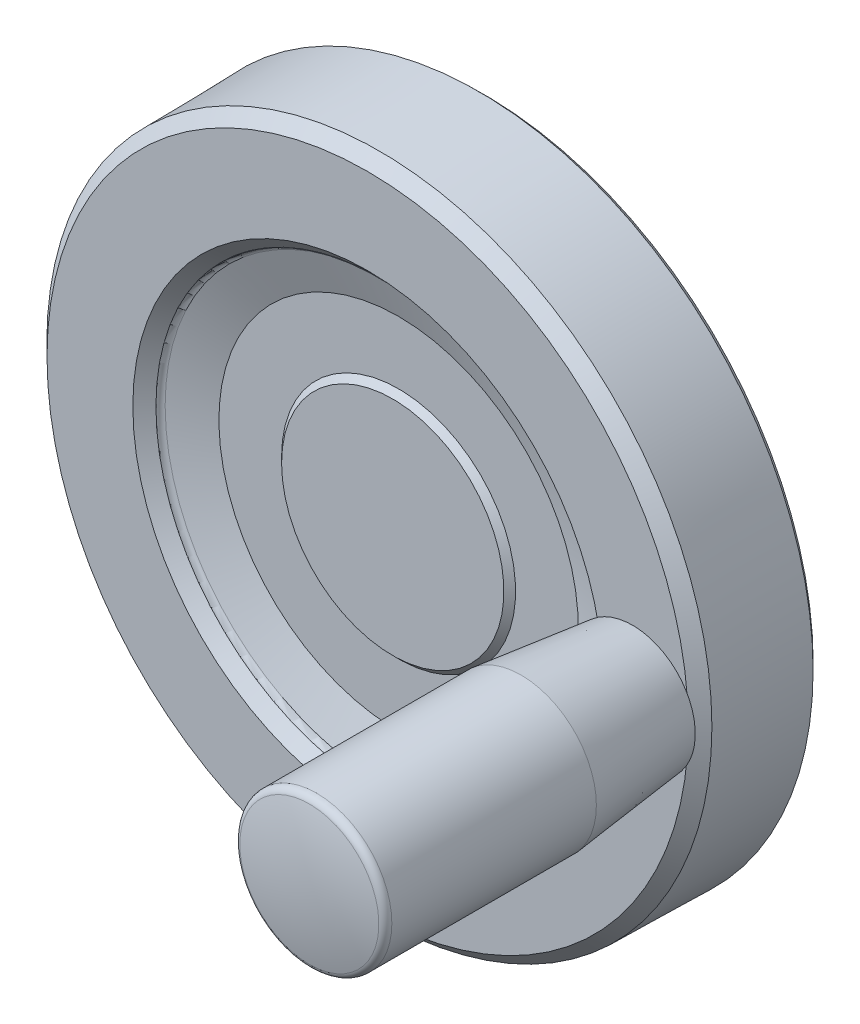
ISO-10303-21;
HEADER;
FILE_DESCRIPTION(('STEP AP214'),'2;1');
FILE_NAME('part.step','',(''),(''),'','','');
FILE_SCHEMA(('AUTOMOTIVE_DESIGN { 1 0 10303 214 1 1 1 1 }'));
ENDSEC;
DATA;
#1=APPLICATION_CONTEXT('core data for automotive mechanical design processes');
#2=APPLICATION_PROTOCOL_DEFINITION('international standard','automotive_design',2000,#1);
#3=PRODUCT_CONTEXT('',#1,'mechanical');
#4=PRODUCT('Part','Part','',(#3));
#5=PRODUCT_RELATED_PRODUCT_CATEGORY('part','',(#4));
#6=PRODUCT_DEFINITION_FORMATION('','',#4);
#7=PRODUCT_DEFINITION_CONTEXT('part definition',#1,'design');
#8=PRODUCT_DEFINITION('design','',#6,#7);
#9=PRODUCT_DEFINITION_SHAPE('','',#8);
#10=(LENGTH_UNIT() NAMED_UNIT(*) SI_UNIT(.MILLI.,.METRE.));
#11=(NAMED_UNIT(*) PLANE_ANGLE_UNIT() SI_UNIT($,.RADIAN.));
#12=(NAMED_UNIT(*) SI_UNIT($,.STERADIAN.) SOLID_ANGLE_UNIT());
#13=UNCERTAINTY_MEASURE_WITH_UNIT(LENGTH_MEASURE(1.E-05),#10,'distance_accuracy_value','');
#14=(GEOMETRIC_REPRESENTATION_CONTEXT(3) GLOBAL_UNCERTAINTY_ASSIGNED_CONTEXT((#13)) GLOBAL_UNIT_ASSIGNED_CONTEXT((#10,
#11,#12)) REPRESENTATION_CONTEXT('',''));
#15=CARTESIAN_POINT('',(0.,0.,0.));
#16=DIRECTION('',(0.,0.,1.));
#17=DIRECTION('',(1.,0.,0.));
#18=AXIS2_PLACEMENT_3D('',#15,#16,#17);
#19=CARTESIAN_POINT('',(32.,0.,18.613499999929));
#20=DIRECTION('',(0.,0.,1.));
#21=DIRECTION('',(-1.,0.,0.));
#22=AXIS2_PLACEMENT_3D('',#19,#20,#21);
#23=CONICAL_SURFACE('',#22,2.99999999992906,0.785398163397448);
#24=CARTESIAN_POINT('',(32.,0.,18.));
#25=DIRECTION('',(0.,0.,1.));
#26=DIRECTION('',(-1.,0.,0.));
#27=AXIS2_PLACEMENT_3D('',#24,#25,#26);
#28=CIRCLE('',#27,2.38650000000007);
#29=CARTESIAN_POINT('',(29.6134999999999,0.,18.));
#30=VERTEX_POINT('',#29);
#31=EDGE_CURVE('E168',#30,#30,#28,.T.);
#32=ORIENTED_EDGE('',*,*,#31,.T.);
#33=EDGE_LOOP('',(#32));
#34=FACE_BOUND('',#33,.T.);
#35=CARTESIAN_POINT('',(32.,0.,18.072));
#36=DIRECTION('',(0.,0.,1.));
#37=DIRECTION('',(0.,1.,0.));
#38=AXIS2_PLACEMENT_3D('',#35,#36,#37);
#39=CIRCLE('',#38,2.4585);
#40=CARTESIAN_POINT('',(32.,2.4585,18.072));
#41=VERTEX_POINT('',#40);
#42=EDGE_CURVE('E9',#41,#41,#39,.T.);
#43=ORIENTED_EDGE('',*,*,#42,.F.);
#44=EDGE_LOOP('',(#43));
#45=FACE_BOUND('',#44,.T.);
#46=ADVANCED_FACE('F15',(#34,#45),#23,.T.);
#47=CARTESIAN_POINT('',(32.,0.,18.));
#48=DIRECTION('',(0.,0.,1.));
#49=DIRECTION('',(-1.,0.,0.));
#50=AXIS2_PLACEMENT_3D('',#47,#48,#49);
#51=PLANE('',#50);
#52=DIRECTION('',(0.866025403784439,-0.5,0.));
#53=VECTOR('',#52,1.);
#54=CARTESIAN_POINT('',(33.5,0.866025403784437,18.));
#55=LINE('',#54,#53);
#56=CARTESIAN_POINT('',(32.,1.73205080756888,18.));
#57=VERTEX_POINT('',#56);
#58=CARTESIAN_POINT('',(33.5,0.866025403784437,18.));
#59=VERTEX_POINT('',#58);
#60=EDGE_CURVE('E35',#57,#59,#55,.T.);
#61=ORIENTED_EDGE('',*,*,#60,.F.);
#62=DIRECTION('',(0.866025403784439,0.5,0.));
#63=VECTOR('',#62,1.);
#64=CARTESIAN_POINT('',(32.,1.73205080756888,18.));
#65=LINE('',#64,#63);
#66=CARTESIAN_POINT('',(30.5,0.866025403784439,18.));
#67=VERTEX_POINT('',#66);
#68=EDGE_CURVE('E108',#67,#57,#65,.T.);
#69=ORIENTED_EDGE('',*,*,#68,.F.);
#70=DIRECTION('',(0.,-1.,0.));
#71=VECTOR('',#70,1.);
#72=CARTESIAN_POINT('',(30.5,0.866025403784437,18.));
#73=LINE('',#72,#71);
#74=CARTESIAN_POINT('',(30.5,-0.86602540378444,18.));
#75=VERTEX_POINT('',#74);
#76=EDGE_CURVE('E145',#75,#67,#73,.F.);
#77=ORIENTED_EDGE('',*,*,#76,.F.);
#78=DIRECTION('',(-0.866025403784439,0.5,0.));
#79=VECTOR('',#78,1.);
#80=CARTESIAN_POINT('',(30.5,-0.866025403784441,18.));
#81=LINE('',#80,#79);
#82=CARTESIAN_POINT('',(32.,-1.73205080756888,18.));
#83=VERTEX_POINT('',#82);
#84=EDGE_CURVE('E138',#83,#75,#81,.T.);
#85=ORIENTED_EDGE('',*,*,#84,.F.);
#86=DIRECTION('',(-0.866025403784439,-0.5,0.));
#87=VECTOR('',#86,1.);
#88=CARTESIAN_POINT('',(32.,-1.73205080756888,18.));
#89=LINE('',#88,#87);
#90=CARTESIAN_POINT('',(33.5,-0.866025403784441,18.));
#91=VERTEX_POINT('',#90);
#92=EDGE_CURVE('E137',#91,#83,#89,.T.);
#93=ORIENTED_EDGE('',*,*,#92,.F.);
#94=DIRECTION('',(0.,-1.,0.));
#95=VECTOR('',#94,1.);
#96=CARTESIAN_POINT('',(33.5,0.,18.));
#97=LINE('',#96,#95);
#98=EDGE_CURVE('E171',#59,#91,#97,.T.);
#99=ORIENTED_EDGE('',*,*,#98,.F.);
#100=EDGE_LOOP('',(#61,#69,#77,#85,#93,#99));
#101=FACE_BOUND('',#100,.T.);
#102=ORIENTED_EDGE('',*,*,#31,.F.);
#103=EDGE_LOOP('',(#102));
#104=FACE_BOUND('',#103,.T.);
#105=ADVANCED_FACE('F220',(#101,#104),#51,.F.);
#106=CARTESIAN_POINT('',(33.5,0.866025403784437,21.25));
#107=DIRECTION('',(-0.5,-0.866025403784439,0.));
#108=DIRECTION('',(0.866025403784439,-0.5,0.));
#109=AXIS2_PLACEMENT_3D('',#106,#107,#108);
#110=PLANE('',#109);
#111=DIRECTION('',(0.866025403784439,-0.5,0.));
#112=VECTOR('',#111,1.);
#113=CARTESIAN_POINT('',(33.5,0.866025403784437,21.25));
#114=LINE('',#113,#112);
#115=CARTESIAN_POINT('',(32.7500000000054,1.29903810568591,21.2499999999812));
#116=VERTEX_POINT('',#115);
#117=CARTESIAN_POINT('',(32.,1.73205080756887,21.25));
#118=VERTEX_POINT('',#117);
#119=EDGE_CURVE('E106',#116,#118,#114,.F.);
#120=ORIENTED_EDGE('',*,*,#119,.T.);
#121=DIRECTION('',(0.,0.,1.));
#122=VECTOR('',#121,1.);
#123=CARTESIAN_POINT('',(32.,1.73205080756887,21.25));
#124=LINE('',#123,#122);
#125=EDGE_CURVE('E122',#118,#57,#124,.F.);
#126=ORIENTED_EDGE('',*,*,#125,.T.);
#127=ORIENTED_EDGE('',*,*,#60,.T.);
#128=DIRECTION('',(0.,0.,-1.));
#129=VECTOR('',#128,1.);
#130=CARTESIAN_POINT('',(33.5,0.866025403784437,21.25));
#131=LINE('',#130,#129);
#132=CARTESIAN_POINT('',(33.5,0.866025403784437,21.25));
#133=VERTEX_POINT('',#132);
#134=EDGE_CURVE('E207',#133,#59,#131,.T.);
#135=ORIENTED_EDGE('',*,*,#134,.F.);
#136=DIRECTION('',(0.866025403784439,-0.5,0.));
#137=VECTOR('',#136,1.);
#138=CARTESIAN_POINT('',(33.5,0.866025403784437,21.25));
#139=LINE('',#138,#137);
#140=EDGE_CURVE('E200',#133,#116,#139,.F.);
#141=ORIENTED_EDGE('',*,*,#140,.T.);
#142=EDGE_LOOP('',(#120,#126,#127,#135,#141));
#143=FACE_BOUND('',#142,.T.);
#144=ADVANCED_FACE('F232',(#143),#110,.T.);
#145=CARTESIAN_POINT('',(32.,1.73205080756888,21.25));
#146=DIRECTION('',(0.5,-0.866025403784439,0.));
#147=DIRECTION('',(0.866025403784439,0.5,0.));
#148=AXIS2_PLACEMENT_3D('',#145,#146,#147);
#149=PLANE('',#148);
#150=DIRECTION('',(0.866025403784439,0.5,0.));
#151=VECTOR('',#150,1.);
#152=CARTESIAN_POINT('',(32.,1.73205080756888,21.25));
#153=LINE('',#152,#151);
#154=CARTESIAN_POINT('',(31.2499999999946,1.29903810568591,21.2499999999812));
#155=VERTEX_POINT('',#154);
#156=CARTESIAN_POINT('',(30.5,0.866025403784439,21.25));
#157=VERTEX_POINT('',#156);
#158=EDGE_CURVE('E112',#155,#157,#153,.F.);
#159=ORIENTED_EDGE('',*,*,#158,.T.);
#160=DIRECTION('',(0.,0.,1.));
#161=VECTOR('',#160,1.);
#162=CARTESIAN_POINT('',(30.5,0.86602540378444,21.25));
#163=LINE('',#162,#161);
#164=EDGE_CURVE('E118',#157,#67,#163,.F.);
#165=ORIENTED_EDGE('',*,*,#164,.T.);
#166=ORIENTED_EDGE('',*,*,#68,.T.);
#167=ORIENTED_EDGE('',*,*,#125,.F.);
#168=DIRECTION('',(0.866025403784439,0.5,0.));
#169=VECTOR('',#168,1.);
#170=CARTESIAN_POINT('',(32.,1.73205080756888,21.25));
#171=LINE('',#170,#169);
#172=EDGE_CURVE('E103',#118,#155,#171,.F.);
#173=ORIENTED_EDGE('',*,*,#172,.T.);
#174=EDGE_LOOP('',(#159,#165,#166,#167,#173));
#175=FACE_BOUND('',#174,.T.);
#176=ADVANCED_FACE('F120',(#175),#149,.T.);
#177=CARTESIAN_POINT('',(30.5,0.866025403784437,21.25));
#178=DIRECTION('',(1.,0.,0.));
#179=DIRECTION('',(0.,0.,1.));
#180=AXIS2_PLACEMENT_3D('',#177,#178,#179);
#181=PLANE('',#180);
#182=DIRECTION('',(0.,-1.,0.));
#183=VECTOR('',#182,1.);
#184=CARTESIAN_POINT('',(30.5,0.866025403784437,21.25));
#185=LINE('',#184,#183);
#186=CARTESIAN_POINT('',(30.4999999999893,0.,21.2499999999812));
#187=VERTEX_POINT('',#186);
#188=CARTESIAN_POINT('',(30.5,-0.86602540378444,21.25));
#189=VERTEX_POINT('',#188);
#190=EDGE_CURVE('E141',#187,#189,#185,.T.);
#191=ORIENTED_EDGE('',*,*,#190,.T.);
#192=DIRECTION('',(0.,0.,1.));
#193=VECTOR('',#192,1.);
#194=CARTESIAN_POINT('',(30.5,-0.86602540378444,21.25));
#195=LINE('',#194,#193);
#196=EDGE_CURVE('E140',#75,#189,#195,.T.);
#197=ORIENTED_EDGE('',*,*,#196,.F.);
#198=ORIENTED_EDGE('',*,*,#76,.T.);
#199=ORIENTED_EDGE('',*,*,#164,.F.);
#200=DIRECTION('',(0.,-1.,0.));
#201=VECTOR('',#200,1.);
#202=CARTESIAN_POINT('',(30.5,0.866025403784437,21.25));
#203=LINE('',#202,#201);
#204=EDGE_CURVE('E114',#157,#187,#203,.T.);
#205=ORIENTED_EDGE('',*,*,#204,.T.);
#206=EDGE_LOOP('',(#191,#197,#198,#199,#205));
#207=FACE_BOUND('',#206,.T.);
#208=ADVANCED_FACE('F233',(#207),#181,.T.);
#209=CARTESIAN_POINT('',(30.5,-0.866025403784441,21.25));
#210=DIRECTION('',(0.5,0.866025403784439,0.));
#211=DIRECTION('',(-0.866025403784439,0.5,0.));
#212=AXIS2_PLACEMENT_3D('',#209,#210,#211);
#213=PLANE('',#212);
#214=DIRECTION('',(0.866025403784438,-0.5,0.));
#215=VECTOR('',#214,1.);
#216=CARTESIAN_POINT('',(31.25,-1.29903810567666,21.25));
#217=LINE('',#216,#215);
#218=CARTESIAN_POINT('',(31.2499999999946,-1.29903810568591,21.2499999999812));
#219=VERTEX_POINT('',#218);
#220=CARTESIAN_POINT('',(32.,-1.73205080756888,21.25));
#221=VERTEX_POINT('',#220);
#222=EDGE_CURVE('E98',#219,#221,#217,.T.);
#223=ORIENTED_EDGE('',*,*,#222,.T.);
#224=DIRECTION('',(0.,0.,1.));
#225=VECTOR('',#224,1.);
#226=CARTESIAN_POINT('',(32.,-1.73205080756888,21.25));
#227=LINE('',#226,#225);
#228=EDGE_CURVE('E132',#83,#221,#227,.T.);
#229=ORIENTED_EDGE('',*,*,#228,.F.);
#230=ORIENTED_EDGE('',*,*,#84,.T.);
#231=ORIENTED_EDGE('',*,*,#196,.T.);
#232=DIRECTION('',(-0.866025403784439,0.5,0.));
#233=VECTOR('',#232,1.);
#234=CARTESIAN_POINT('',(30.5,-0.866025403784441,21.25));
#235=LINE('',#234,#233);
#236=EDGE_CURVE('E134',#189,#219,#235,.F.);
#237=ORIENTED_EDGE('',*,*,#236,.T.);
#238=EDGE_LOOP('',(#223,#229,#230,#231,#237));
#239=FACE_BOUND('',#238,.T.);
#240=ADVANCED_FACE('F224',(#239),#213,.T.);
#241=CARTESIAN_POINT('',(32.,-1.73205080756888,21.25));
#242=DIRECTION('',(-0.5,0.866025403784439,0.));
#243=DIRECTION('',(-0.866025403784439,-0.5,0.));
#244=AXIS2_PLACEMENT_3D('',#241,#242,#243);
#245=PLANE('',#244);
#246=DIRECTION('',(0.866025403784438,0.5,0.));
#247=VECTOR('',#246,1.);
#248=CARTESIAN_POINT('',(32.75,-1.29903810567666,21.25));
#249=LINE('',#248,#247);
#250=CARTESIAN_POINT('',(32.7500000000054,-1.29903810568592,21.2499999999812));
#251=VERTEX_POINT('',#250);
#252=CARTESIAN_POINT('',(33.5,-0.866025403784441,21.25));
#253=VERTEX_POINT('',#252);
#254=EDGE_CURVE('E131',#251,#253,#249,.T.);
#255=ORIENTED_EDGE('',*,*,#254,.T.);
#256=DIRECTION('',(0.,0.,-1.));
#257=VECTOR('',#256,1.);
#258=CARTESIAN_POINT('',(33.5,-0.866025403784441,21.25));
#259=LINE('',#258,#257);
#260=EDGE_CURVE('E202',#91,#253,#259,.F.);
#261=ORIENTED_EDGE('',*,*,#260,.F.);
#262=ORIENTED_EDGE('',*,*,#92,.T.);
#263=ORIENTED_EDGE('',*,*,#228,.T.);
#264=DIRECTION('',(-0.866025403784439,-0.5,0.));
#265=VECTOR('',#264,1.);
#266=CARTESIAN_POINT('',(32.,-1.73205080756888,21.25));
#267=LINE('',#266,#265);
#268=EDGE_CURVE('E128',#221,#251,#267,.F.);
#269=ORIENTED_EDGE('',*,*,#268,.T.);
#270=EDGE_LOOP('',(#255,#261,#262,#263,#269));
#271=FACE_BOUND('',#270,.T.);
#272=ADVANCED_FACE('F222',(#271),#245,.T.);
#273=CARTESIAN_POINT('',(33.5,-0.866025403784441,21.25));
#274=DIRECTION('',(-1.,0.,0.));
#275=DIRECTION('',(0.,0.,-1.));
#276=AXIS2_PLACEMENT_3D('',#273,#274,#275);
#277=PLANE('',#276);
#278=DIRECTION('',(0.,-1.,0.));
#279=VECTOR('',#278,1.);
#280=CARTESIAN_POINT('',(33.5,-0.866025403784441,21.25));
#281=LINE('',#280,#279);
#282=CARTESIAN_POINT('',(33.5000000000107,0.,21.2499999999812));
#283=VERTEX_POINT('',#282);
#284=EDGE_CURVE('E214',#283,#133,#281,.F.);
#285=ORIENTED_EDGE('',*,*,#284,.T.);
#286=ORIENTED_EDGE('',*,*,#134,.T.);
#287=ORIENTED_EDGE('',*,*,#98,.T.);
#288=ORIENTED_EDGE('',*,*,#260,.T.);
#289=DIRECTION('',(0.,-1.,0.));
#290=VECTOR('',#289,1.);
#291=CARTESIAN_POINT('',(33.5,-0.866025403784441,21.25));
#292=LINE('',#291,#290);
#293=EDGE_CURVE('E193',#253,#283,#292,.F.);
#294=ORIENTED_EDGE('',*,*,#293,.T.);
#295=EDGE_LOOP('',(#285,#286,#287,#288,#294));
#296=FACE_BOUND('',#295,.T.);
#297=ADVANCED_FACE('F218',(#296),#277,.T.);
#298=CARTESIAN_POINT('',(32.,0.,21.25));
#299=DIRECTION('',(0.,0.,1.));
#300=DIRECTION('',(-1.,0.,0.));
#301=AXIS2_PLACEMENT_3D('',#298,#299,#300);
#302=PLANE('',#301);
#303=ORIENTED_EDGE('',*,*,#172,.F.);
#304=ORIENTED_EDGE('',*,*,#119,.F.);
#305=CARTESIAN_POINT('',(32.,0.,21.2499999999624));
#306=DIRECTION('',(0.,0.,-1.));
#307=DIRECTION('',(0.,1.,0.));
#308=AXIS2_PLACEMENT_3D('',#305,#306,#307);
#309=CIRCLE('',#308,1.50000000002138);
#310=EDGE_CURVE('E91',#155,#116,#309,.T.);
#311=ORIENTED_EDGE('',*,*,#310,.F.);
#312=EDGE_LOOP('',(#303,#304,#311));
#313=FACE_BOUND('',#312,.T.);
#314=ADVANCED_FACE('F101',(#313),#302,.F.);
#315=CARTESIAN_POINT('',(32.,0.,21.25));
#316=DIRECTION('',(0.,0.,1.));
#317=DIRECTION('',(-1.,0.,0.));
#318=AXIS2_PLACEMENT_3D('',#315,#316,#317);
#319=PLANE('',#318);
#320=ORIENTED_EDGE('',*,*,#140,.F.);
#321=ORIENTED_EDGE('',*,*,#284,.F.);
#322=CARTESIAN_POINT('',(32.,0.,21.2499999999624));
#323=DIRECTION('',(0.,0.,-1.));
#324=DIRECTION('',(0.,1.,0.));
#325=AXIS2_PLACEMENT_3D('',#322,#323,#324);
#326=CIRCLE('',#325,1.50000000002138);
#327=EDGE_CURVE('E172',#116,#283,#326,.T.);
#328=ORIENTED_EDGE('',*,*,#327,.F.);
#329=EDGE_LOOP('',(#320,#321,#328));
#330=FACE_BOUND('',#329,.T.);
#331=ADVANCED_FACE('F238',(#330),#319,.F.);
#332=CARTESIAN_POINT('',(32.,0.,21.25));
#333=DIRECTION('',(0.,0.,1.));
#334=DIRECTION('',(-1.,0.,0.));
#335=AXIS2_PLACEMENT_3D('',#332,#333,#334);
#336=PLANE('',#335);
#337=ORIENTED_EDGE('',*,*,#204,.F.);
#338=ORIENTED_EDGE('',*,*,#158,.F.);
#339=CARTESIAN_POINT('',(32.,0.,21.2499999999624));
#340=DIRECTION('',(0.,0.,-1.));
#341=DIRECTION('',(0.,1.,0.));
#342=AXIS2_PLACEMENT_3D('',#339,#340,#341);
#343=CIRCLE('',#342,1.50000000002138);
#344=EDGE_CURVE('E19',#155,#187,#343,.F.);
#345=ORIENTED_EDGE('',*,*,#344,.T.);
#346=EDGE_LOOP('',(#337,#338,#345));
#347=FACE_BOUND('',#346,.T.);
#348=ADVANCED_FACE('F113',(#347),#336,.F.);
#349=CARTESIAN_POINT('',(32.,0.,21.25));
#350=DIRECTION('',(0.,0.,1.));
#351=DIRECTION('',(-1.,0.,0.));
#352=AXIS2_PLACEMENT_3D('',#349,#350,#351);
#353=PLANE('',#352);
#354=ORIENTED_EDGE('',*,*,#236,.F.);
#355=ORIENTED_EDGE('',*,*,#190,.F.);
#356=CARTESIAN_POINT('',(32.,0.,21.2499999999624));
#357=DIRECTION('',(0.,0.,-1.));
#358=DIRECTION('',(0.,1.,0.));
#359=AXIS2_PLACEMENT_3D('',#356,#357,#358);
#360=CIRCLE('',#359,1.50000000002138);
#361=EDGE_CURVE('E94',#187,#219,#360,.F.);
#362=ORIENTED_EDGE('',*,*,#361,.T.);
#363=EDGE_LOOP('',(#354,#355,#362));
#364=FACE_BOUND('',#363,.T.);
#365=ADVANCED_FACE('F17',(#364),#353,.F.);
#366=CARTESIAN_POINT('',(32.,0.,21.25));
#367=DIRECTION('',(0.,0.,1.));
#368=DIRECTION('',(-1.,0.,0.));
#369=AXIS2_PLACEMENT_3D('',#366,#367,#368);
#370=PLANE('',#369);
#371=ORIENTED_EDGE('',*,*,#268,.F.);
#372=ORIENTED_EDGE('',*,*,#222,.F.);
#373=CARTESIAN_POINT('',(32.,0.,21.2499999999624));
#374=DIRECTION('',(0.,0.,-1.));
#375=DIRECTION('',(0.,1.,0.));
#376=AXIS2_PLACEMENT_3D('',#373,#374,#375);
#377=CIRCLE('',#376,1.50000000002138);
#378=EDGE_CURVE('E109',#219,#251,#377,.F.);
#379=ORIENTED_EDGE('',*,*,#378,.T.);
#380=EDGE_LOOP('',(#371,#372,#379));
#381=FACE_BOUND('',#380,.T.);
#382=ADVANCED_FACE('F183',(#381),#370,.F.);
#383=CARTESIAN_POINT('',(32.,0.,21.25));
#384=DIRECTION('',(0.,0.,1.));
#385=DIRECTION('',(-1.,0.,0.));
#386=AXIS2_PLACEMENT_3D('',#383,#384,#385);
#387=PLANE('',#386);
#388=ORIENTED_EDGE('',*,*,#293,.F.);
#389=ORIENTED_EDGE('',*,*,#254,.F.);
#390=CARTESIAN_POINT('',(32.,0.,21.2499999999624));
#391=DIRECTION('',(0.,0.,-1.));
#392=DIRECTION('',(0.,1.,0.));
#393=AXIS2_PLACEMENT_3D('',#390,#391,#392);
#394=CIRCLE('',#393,1.50000000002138);
#395=EDGE_CURVE('E174',#283,#251,#394,.T.);
#396=ORIENTED_EDGE('',*,*,#395,.F.);
#397=EDGE_LOOP('',(#388,#389,#396));
#398=FACE_BOUND('',#397,.T.);
#399=ADVANCED_FACE('F191',(#398),#387,.F.);
#400=CARTESIAN_POINT('',(32.,0.,21.2500000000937));
#401=DIRECTION('',(0.,0.,-1.));
#402=DIRECTION('',(0.,1.,0.));
#403=AXIS2_PLACEMENT_3D('',#400,#401,#402);
#404=CONICAL_SURFACE('',#403,1.499999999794,1.04719755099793);
#405=CARTESIAN_POINT('',(31.9999999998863,0.,22.1160254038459));
#406=VERTEX_POINT('',#405);
#407=VERTEX_LOOP('',#406);
#408=FACE_BOUND('',#407,.T.);
#409=ORIENTED_EDGE('',*,*,#378,.F.);
#410=ORIENTED_EDGE('',*,*,#361,.F.);
#411=ORIENTED_EDGE('',*,*,#344,.F.);
#412=ORIENTED_EDGE('',*,*,#310,.T.);
#413=ORIENTED_EDGE('',*,*,#327,.T.);
#414=ORIENTED_EDGE('',*,*,#395,.T.);
#415=EDGE_LOOP('',(#409,#410,#411,#412,#413,#414));
#416=FACE_BOUND('',#415,.T.);
#417=ADVANCED_FACE('F90',(#408,#416),#404,.F.);
#418=CARTESIAN_POINT('',(32.,0.,71.));
#419=DIRECTION('',(0.,0.,-1.));
#420=DIRECTION('',(1.,0.,0.));
#421=AXIS2_PLACEMENT_3D('',#418,#419,#420);
#422=CYLINDRICAL_SURFACE('',#421,3.9);
#423=CARTESIAN_POINT('',(32.,0.,31.));
#424=DIRECTION('',(0.,0.,-1.));
#425=DIRECTION('',(-1.,0.,0.));
#426=AXIS2_PLACEMENT_3D('',#423,#424,#425);
#427=CIRCLE('',#426,3.9);
#428=CARTESIAN_POINT('',(28.1,0.,31.));
#429=VERTEX_POINT('',#428);
#430=EDGE_CURVE('E285',#429,#429,#427,.T.);
#431=ORIENTED_EDGE('',*,*,#430,.F.);
#432=EDGE_LOOP('',(#431));
#433=FACE_BOUND('',#432,.T.);
#434=CARTESIAN_POINT('',(32.,0.,31.3));
#435=DIRECTION('',(0.,0.,-1.));
#436=DIRECTION('',(1.,0.,0.));
#437=AXIS2_PLACEMENT_3D('',#434,#435,#436);
#438=CIRCLE('',#437,3.9);
#439=CARTESIAN_POINT('',(35.9,0.,31.3));
#440=VERTEX_POINT('',#439);
#441=EDGE_CURVE('E159',#440,#440,#438,.T.);
#442=ORIENTED_EDGE('',*,*,#441,.T.);
#443=EDGE_LOOP('',(#442));
#444=FACE_BOUND('',#443,.T.);
#445=ADVANCED_FACE('F471',(#433,#444),#422,.T.);
#446=CARTESIAN_POINT('',(32.,-3.9,31.3));
#447=DIRECTION('',(0.,0.,1.));
#448=DIRECTION('',(-1.,0.,0.));
#449=AXIS2_PLACEMENT_3D('',#446,#447,#448);
#450=PLANE('',#449);
#451=ORIENTED_EDGE('',*,*,#441,.F.);
#452=EDGE_LOOP('',(#451));
#453=FACE_BOUND('',#452,.T.);
#454=CARTESIAN_POINT('',(32.,0.,31.3));
#455=DIRECTION('',(0.,0.,1.));
#456=DIRECTION('',(-1.,0.,0.));
#457=AXIS2_PLACEMENT_3D('',#454,#455,#456);
#458=CIRCLE('',#457,7.5);
#459=CARTESIAN_POINT('',(24.5,0.,31.3));
#460=VERTEX_POINT('',#459);
#461=EDGE_CURVE('E152',#460,#460,#458,.T.);
#462=ORIENTED_EDGE('',*,*,#461,.F.);
#463=EDGE_LOOP('',(#462));
#464=FACE_BOUND('',#463,.T.);
#465=ADVANCED_FACE('F264',(#453,#464),#450,.F.);
#466=CARTESIAN_POINT('',(32.,0.,44.6333333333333));
#467=DIRECTION('',(0.,0.,1.));
#468=DIRECTION('',(-1.,0.,0.));
#469=AXIS2_PLACEMENT_3D('',#466,#467,#468);
#470=CONICAL_SURFACE('',#469,9.,0.112028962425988);
#471=ORIENTED_EDGE('',*,*,#461,.T.);
#472=EDGE_LOOP('',(#471));
#473=FACE_BOUND('',#472,.T.);
#474=CARTESIAN_POINT('',(32.,0.,44.6333333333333));
#475=DIRECTION('',(0.,0.,-1.));
#476=DIRECTION('',(1.,0.,0.));
#477=AXIS2_PLACEMENT_3D('',#474,#475,#476);
#478=CIRCLE('',#477,9.);
#479=CARTESIAN_POINT('',(41.,0.,44.6333333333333));
#480=VERTEX_POINT('',#479);
#481=EDGE_CURVE('E277',#480,#480,#478,.F.);
#482=ORIENTED_EDGE('',*,*,#481,.F.);
#483=EDGE_LOOP('',(#482));
#484=FACE_BOUND('',#483,.T.);
#485=ADVANCED_FACE('F259',(#473,#484),#470,.T.);
#486=CARTESIAN_POINT('',(32.,0.,71.));
#487=DIRECTION('',(0.,0.,-1.));
#488=DIRECTION('',(1.,0.,0.));
#489=AXIS2_PLACEMENT_3D('',#486,#487,#488);
#490=CYLINDRICAL_SURFACE('',#489,9.);
#491=ORIENTED_EDGE('',*,*,#481,.T.);
#492=EDGE_LOOP('',(#491));
#493=FACE_BOUND('',#492,.T.);
#494=CARTESIAN_POINT('',(32.,0.,69.1044681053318));
#495=DIRECTION('',(0.,0.,-1.));
#496=DIRECTION('',(1.,0.,0.));
#497=AXIS2_PLACEMENT_3D('',#494,#495,#496);
#498=CIRCLE('',#497,9.);
#499=CARTESIAN_POINT('',(41.,0.,69.1044681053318));
#500=VERTEX_POINT('',#499);
#501=EDGE_CURVE('E155',#500,#500,#498,.T.);
#502=ORIENTED_EDGE('',*,*,#501,.T.);
#503=EDGE_LOOP('',(#502));
#504=FACE_BOUND('',#503,.T.);
#505=ADVANCED_FACE('F255',(#493,#504),#490,.T.);
#506=CARTESIAN_POINT('',(32.,0.,69.1044681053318));
#507=DIRECTION('',(0.,0.,1.));
#508=DIRECTION('',(-1.,0.,0.));
#509=AXIS2_PLACEMENT_3D('',#506,#507,#508);
#510=TOROIDAL_SURFACE('',#509,8.1,0.9);
#511=CARTESIAN_POINT('',(32.,0.,69.977682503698));
#512=DIRECTION('',(0.,0.,1.));
#513=DIRECTION('',(-1.,0.,0.));
#514=AXIS2_PLACEMENT_3D('',#511,#512,#513);
#515=CIRCLE('',#514,8.31793718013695);
#516=CARTESIAN_POINT('',(23.682062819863,0.,69.977682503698));
#517=VERTEX_POINT('',#516);
#518=EDGE_CURVE('E156',#517,#517,#515,.F.);
#519=ORIENTED_EDGE('',*,*,#518,.T.);
#520=EDGE_LOOP('',(#519));
#521=FACE_BOUND('',#520,.T.);
#522=ORIENTED_EDGE('',*,*,#501,.F.);
#523=EDGE_LOOP('',(#522));
#524=FACE_BOUND('',#523,.T.);
#525=ADVANCED_FACE('F258',(#521,#524),#510,.T.);
#526=CARTESIAN_POINT('',(32.,-1.17818513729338E-13,36.6500000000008));
#527=DIRECTION('',(0.,1.,0.));
#528=DIRECTION('',(-1.,0.,0.));
#529=AXIS2_PLACEMENT_3D('',#526,#527,#528);
#530=SPHERICAL_SURFACE('',#529,34.3499999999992);
#531=ORIENTED_EDGE('',*,*,#518,.F.);
#532=EDGE_LOOP('',(#531));
#533=FACE_BOUND('',#532,.T.);
#534=ADVANCED_FACE('F268',(#533),#530,.T.);
#535=CARTESIAN_POINT('',(32.,0.,17.));
#536=DIRECTION('',(0.,0.,1.));
#537=DIRECTION('',(0.,1.,0.));
#538=AXIS2_PLACEMENT_3D('',#535,#536,#537);
#539=CYLINDRICAL_SURFACE('',#538,2.4585);
#540=ORIENTED_EDGE('',*,*,#42,.T.);
#541=EDGE_LOOP('',(#540));
#542=FACE_BOUND('',#541,.T.);
#543=CARTESIAN_POINT('',(32.,0.,17.541499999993));
#544=DIRECTION('',(0.,0.,-1.));
#545=DIRECTION('',(0.,-1.,0.));
#546=AXIS2_PLACEMENT_3D('',#543,#544,#545);
#547=CIRCLE('',#546,2.45849999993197);
#548=CARTESIAN_POINT('',(32.,-2.45849999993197,17.541499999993));
#549=VERTEX_POINT('',#548);
#550=EDGE_CURVE('E787',#549,#549,#547,.T.);
#551=ORIENTED_EDGE('',*,*,#550,.T.);
#552=EDGE_LOOP('',(#551));
#553=FACE_BOUND('',#552,.T.);
#554=ADVANCED_FACE('F261',(#542,#553),#539,.F.);
#555=CARTESIAN_POINT('',(32.,0.,17.0000000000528));
#556=DIRECTION('',(0.,0.,-1.));
#557=DIRECTION('',(0.,-1.,0.));
#558=AXIS2_PLACEMENT_3D('',#555,#556,#557);
#559=CONICAL_SURFACE('',#558,2.99999999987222,0.785398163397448);
#560=ORIENTED_EDGE('',*,*,#550,.F.);
#561=EDGE_LOOP('',(#560));
#562=FACE_BOUND('',#561,.T.);
#563=CARTESIAN_POINT('',(32.,0.,16.9999999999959));
#564=DIRECTION('',(0.,0.,-1.));
#565=DIRECTION('',(0.,-1.,0.));
#566=AXIS2_PLACEMENT_3D('',#563,#564,#565);
#567=CIRCLE('',#566,2.99999999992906);
#568=CARTESIAN_POINT('',(32.,-2.99999999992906,16.9999999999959));
#569=VERTEX_POINT('',#568);
#570=EDGE_CURVE('E312',#569,#569,#567,.T.);
#571=ORIENTED_EDGE('',*,*,#570,.T.);
#572=EDGE_LOOP('',(#571));
#573=FACE_BOUND('',#572,.T.);
#574=ADVANCED_FACE('F588',(#562,#573),#559,.F.);
#575=CARTESIAN_POINT('',(-39.3122185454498,0.,17.));
#576=DIRECTION('',(0.,0.,1.));
#577=DIRECTION('',(1.,0.,0.));
#578=AXIS2_PLACEMENT_3D('',#575,#576,#577);
#579=PLANE('',#578);
#580=CARTESIAN_POINT('',(0.,0.,17.));
#581=DIRECTION('',(0.,0.,1.));
#582=DIRECTION('',(1.,0.,0.));
#583=AXIS2_PLACEMENT_3D('',#580,#581,#582);
#584=CIRCLE('',#583,39.3122185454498);
#585=CARTESIAN_POINT('',(39.3122185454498,0.,17.));
#586=VERTEX_POINT('',#585);
#587=EDGE_CURVE('E322',#586,#586,#584,.T.);
#588=ORIENTED_EDGE('',*,*,#587,.F.);
#589=EDGE_LOOP('',(#588));
#590=FACE_BOUND('',#589,.T.);
#591=ORIENTED_EDGE('',*,*,#570,.F.);
#592=EDGE_LOOP('',(#591));
#593=FACE_BOUND('',#592,.T.);
#594=CARTESIAN_POINT('',(0.,0.,17.));
#595=DIRECTION('',(0.,0.,1.));
#596=DIRECTION('',(1.,0.,0.));
#597=AXIS2_PLACEMENT_3D('',#594,#595,#596);
#598=CIRCLE('',#597,26.6666666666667);
#599=CARTESIAN_POINT('',(26.6666666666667,0.,17.));
#600=VERTEX_POINT('',#599);
#601=EDGE_CURVE('E309',#600,#600,#598,.F.);
#602=ORIENTED_EDGE('',*,*,#601,.F.);
#603=EDGE_LOOP('',(#602));
#604=FACE_BOUND('',#603,.T.);
#605=ADVANCED_FACE('F597',(#590,#593,#604),#579,.F.);
#606=CARTESIAN_POINT('',(-28.098425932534,0.,31.));
#607=DIRECTION('',(0.,0.,-1.));
#608=DIRECTION('',(-1.,0.,0.));
#609=AXIS2_PLACEMENT_3D('',#606,#607,#608);
#610=PLANE('',#609);
#611=ORIENTED_EDGE('',*,*,#430,.T.);
#612=EDGE_LOOP('',(#611));
#613=FACE_BOUND('',#612,.T.);
#614=CARTESIAN_POINT('',(0.,0.,31.));
#615=DIRECTION('',(0.,0.,1.));
#616=DIRECTION('',(0.,1.,0.));
#617=AXIS2_PLACEMENT_3D('',#614,#615,#616);
#618=CIRCLE('',#617,28.098425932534);
#619=CARTESIAN_POINT('',(0.,28.098425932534,31.));
#620=VERTEX_POINT('',#619);
#621=EDGE_CURVE('E319',#620,#620,#618,.T.);
#622=ORIENTED_EDGE('',*,*,#621,.F.);
#623=EDGE_LOOP('',(#622));
#624=FACE_BOUND('',#623,.T.);
#625=CARTESIAN_POINT('',(0.,0.,31.));
#626=DIRECTION('',(0.,0.,-1.));
#627=DIRECTION('',(-1.,0.,0.));
#628=AXIS2_PLACEMENT_3D('',#625,#626,#627);
#629=CIRCLE('',#628,38.3678476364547);
#630=CARTESIAN_POINT('',(-38.3678476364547,0.,31.));
#631=VERTEX_POINT('',#630);
#632=EDGE_CURVE('E325',#631,#631,#629,.T.);
#633=ORIENTED_EDGE('',*,*,#632,.F.);
#634=EDGE_LOOP('',(#633));
#635=FACE_BOUND('',#634,.T.);
#636=ADVANCED_FACE('F607',(#613,#624,#635),#610,.F.);
#637=CARTESIAN_POINT('',(0.,0.,31.));
#638=DIRECTION('',(0.,0.,1.));
#639=DIRECTION('',(0.,1.,0.));
#640=AXIS2_PLACEMENT_3D('',#637,#638,#639);
#641=CONICAL_SURFACE('',#640,28.098425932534,0.794124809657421);
#642=CARTESIAN_POINT('',(0.,0.,29.6002132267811));
#643=DIRECTION('',(0.,0.,1.));
#644=DIRECTION('',(1.,0.,0.));
#645=AXIS2_PLACEMENT_3D('',#642,#643,#644);
#646=CIRCLE('',#645,26.6739925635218);
#647=CARTESIAN_POINT('',(26.6739925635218,0.,29.6002132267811));
#648=VERTEX_POINT('',#647);
#649=EDGE_CURVE('E313',#648,#648,#646,.T.);
#650=ORIENTED_EDGE('',*,*,#649,.F.);
#651=EDGE_LOOP('',(#650));
#652=FACE_BOUND('',#651,.T.);
#653=ORIENTED_EDGE('',*,*,#621,.T.);
#654=EDGE_LOOP('',(#653));
#655=FACE_BOUND('',#654,.T.);
#656=ADVANCED_FACE('F617',(#652,#655),#641,.F.);
#657=CARTESIAN_POINT('',(0.,0.,29.600213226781));
#658=DIRECTION('',(0.,0.,-1.));
#659=DIRECTION('',(-1.,0.,0.));
#660=AXIS2_PLACEMENT_3D('',#657,#658,#659);
#661=CONICAL_SURFACE('',#660,39.7922810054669,0.794124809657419);
#662=ORIENTED_EDGE('',*,*,#632,.T.);
#663=EDGE_LOOP('',(#662));
#664=FACE_BOUND('',#663,.T.);
#665=CARTESIAN_POINT('',(0.,0.,29.6002132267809));
#666=DIRECTION('',(0.,0.,-1.));
#667=DIRECTION('',(-1.,0.,0.));
#668=AXIS2_PLACEMENT_3D('',#665,#666,#667);
#669=CIRCLE('',#668,39.7922810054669);
#670=CARTESIAN_POINT('',(-39.7922810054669,0.,29.6002132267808));
#671=VERTEX_POINT('',#670);
#672=EDGE_CURVE('E288',#671,#671,#669,.T.);
#673=ORIENTED_EDGE('',*,*,#672,.F.);
#674=EDGE_LOOP('',(#673));
#675=FACE_BOUND('',#674,.T.);
#676=ADVANCED_FACE('F627',(#664,#675),#661,.T.);
#677=CARTESIAN_POINT('',(0.,0.,29.66153627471));
#678=DIRECTION('',(0.,0.,1.));
#679=DIRECTION('',(0.,1.,0.));
#680=AXIS2_PLACEMENT_3D('',#677,#678,#679);
#681=CONICAL_SURFACE('',#680,26.675062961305,0.0174532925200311);
#682=CARTESIAN_POINT('',(0.,0.,29.6615362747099));
#683=DIRECTION('',(0.,0.,1.));
#684=DIRECTION('',(1.,0.,0.));
#685=AXIS2_PLACEMENT_3D('',#682,#683,#684);
#686=CIRCLE('',#685,26.675062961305);
#687=CARTESIAN_POINT('',(26.675062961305,0.,29.66153627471));
#688=VERTEX_POINT('',#687);
#689=EDGE_CURVE('E774',#688,#688,#686,.F.);
#690=ORIENTED_EDGE('',*,*,#689,.T.);
#691=EDGE_LOOP('',(#690));
#692=FACE_BOUND('',#691,.T.);
#693=ORIENTED_EDGE('',*,*,#649,.T.);
#694=EDGE_LOOP('',(#693));
#695=FACE_BOUND('',#694,.T.);
#696=ADVANCED_FACE('F637',(#692,#695),#681,.T.);
#697=CARTESIAN_POINT('',(0.,0.,17.6998933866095));
#698=DIRECTION('',(0.,0.,-1.));
#699=DIRECTION('',(-1.,0.,0.));
#700=AXIS2_PLACEMENT_3D('',#697,#698,#699);
#701=CONICAL_SURFACE('',#700,40.0000018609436,0.0174532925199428);
#702=ORIENTED_EDGE('',*,*,#672,.T.);
#703=EDGE_LOOP('',(#702));
#704=FACE_BOUND('',#703,.T.);
#705=CARTESIAN_POINT('',(0.,0.,17.6998933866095));
#706=DIRECTION('',(0.,0.,-1.));
#707=DIRECTION('',(-1.,0.,0.));
#708=AXIS2_PLACEMENT_3D('',#705,#706,#707);
#709=CIRCLE('',#708,40.0000018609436);
#710=CARTESIAN_POINT('',(-40.0000018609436,0.,17.6998933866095));
#711=VERTEX_POINT('',#710);
#712=EDGE_CURVE('E328',#711,#711,#709,.F.);
#713=ORIENTED_EDGE('',*,*,#712,.T.);
#714=EDGE_LOOP('',(#713));
#715=FACE_BOUND('',#714,.T.);
#716=ADVANCED_FACE('F647',(#704,#715),#701,.T.);
#717=CARTESIAN_POINT('',(0.,0.,29.673752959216));
#718=DIRECTION('',(0.,0.,-1.));
#719=DIRECTION('',(-1.,0.,0.));
#720=AXIS2_PLACEMENT_3D('',#717,#718,#719);
#721=TOROIDAL_SURFACE('',#720,25.9751695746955,0.7);
#722=CARTESIAN_POINT('',(0.,0.,29.0159681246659));
#723=DIRECTION('',(0.,0.,-1.));
#724=DIRECTION('',(-1.,0.,0.));
#725=AXIS2_PLACEMENT_3D('',#722,#723,#724);
#726=CIRCLE('',#725,26.2145836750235);
#727=CARTESIAN_POINT('',(-26.2145836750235,0.,29.0159681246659));
#728=VERTEX_POINT('',#727);
#729=EDGE_CURVE('E761',#728,#728,#726,.F.);
#730=ORIENTED_EDGE('',*,*,#729,.F.);
#731=EDGE_LOOP('',(#730));
#732=FACE_BOUND('',#731,.T.);
#733=ORIENTED_EDGE('',*,*,#689,.F.);
#734=EDGE_LOOP('',(#733));
#735=FACE_BOUND('',#734,.T.);
#736=ADVANCED_FACE('F657',(#732,#735),#721,.F.);
#737=CARTESIAN_POINT('',(0.,0.,17.6998933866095));
#738=DIRECTION('',(0.,0.,1.));
#739=DIRECTION('',(1.,0.,0.));
#740=AXIS2_PLACEMENT_3D('',#737,#738,#739);
#741=CONICAL_SURFACE('',#740,40.0000018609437,0.776671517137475);
#742=ORIENTED_EDGE('',*,*,#712,.F.);
#743=EDGE_LOOP('',(#742));
#744=FACE_BOUND('',#743,.T.);
#745=ORIENTED_EDGE('',*,*,#587,.T.);
#746=EDGE_LOOP('',(#745));
#747=FACE_BOUND('',#746,.T.);
#748=ADVANCED_FACE('F667',(#744,#747),#741,.T.);
#749=CARTESIAN_POINT('',(0.,0.,0.));
#750=DIRECTION('',(0.,0.,1.));
#751=DIRECTION('',(1.,0.,0.));
#752=AXIS2_PLACEMENT_3D('',#749,#750,#751);
#753=CYLINDRICAL_SURFACE('',#752,26.6666666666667);
#754=ORIENTED_EDGE('',*,*,#601,.T.);
#755=EDGE_LOOP('',(#754));
#756=FACE_BOUND('',#755,.T.);
#757=CARTESIAN_POINT('',(0.,0.,18.6542311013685));
#758=DIRECTION('',(0.,0.,1.));
#759=DIRECTION('',(1.,0.,0.));
#760=AXIS2_PLACEMENT_3D('',#757,#758,#759);
#761=CIRCLE('',#760,26.6666666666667);
#762=CARTESIAN_POINT('',(26.6666666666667,0.,18.6542311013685));
#763=VERTEX_POINT('',#762);
#764=EDGE_CURVE('E777',#763,#763,#761,.F.);
#765=ORIENTED_EDGE('',*,*,#764,.F.);
#766=EDGE_LOOP('',(#765));
#767=FACE_BOUND('',#766,.T.);
#768=ADVANCED_FACE('F677',(#756,#767),#753,.F.);
#769=CARTESIAN_POINT('',(0.,0.,29.0159681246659));
#770=DIRECTION('',(0.,0.,1.));
#771=DIRECTION('',(0.,1.,0.));
#772=AXIS2_PLACEMENT_3D('',#769,#770,#771);
#773=CONICAL_SURFACE('',#772,26.2145836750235,1.22173047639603);
#774=CARTESIAN_POINT('',(0.,0.,27.3));
#775=DIRECTION('',(0.,0.,1.));
#776=DIRECTION('',(0.,1.,0.));
#777=AXIS2_PLACEMENT_3D('',#774,#775,#776);
#778=CIRCLE('',#777,21.5);
#779=CARTESIAN_POINT('',(0.,21.5,27.3));
#780=VERTEX_POINT('',#779);
#781=EDGE_CURVE('E305',#780,#780,#778,.T.);
#782=ORIENTED_EDGE('',*,*,#781,.F.);
#783=EDGE_LOOP('',(#782));
#784=FACE_BOUND('',#783,.T.);
#785=ORIENTED_EDGE('',*,*,#729,.T.);
#786=EDGE_LOOP('',(#785));
#787=FACE_BOUND('',#786,.T.);
#788=ADVANCED_FACE('F349',(#784,#787),#773,.F.);
#789=CARTESIAN_POINT('',(0.,0.,18.6542311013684));
#790=DIRECTION('',(0.,0.,-1.));
#791=DIRECTION('',(-1.,0.,0.));
#792=AXIS2_PLACEMENT_3D('',#789,#790,#791);
#793=TOROIDAL_SURFACE('',#792,25.9666666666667,0.7);
#794=ORIENTED_EDGE('',*,*,#764,.T.);
#795=EDGE_LOOP('',(#794));
#796=FACE_BOUND('',#795,.T.);
#797=CARTESIAN_POINT('',(0.,0.,19.2604488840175));
#798=DIRECTION('',(0.,0.,-1.));
#799=DIRECTION('',(-1.,0.,0.));
#800=AXIS2_PLACEMENT_3D('',#797,#798,#799);
#801=CIRCLE('',#800,25.6166666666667);
#802=CARTESIAN_POINT('',(-25.6166666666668,0.,19.2604488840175));
#803=VERTEX_POINT('',#802);
#804=EDGE_CURVE('E764',#803,#803,#801,.T.);
#805=ORIENTED_EDGE('',*,*,#804,.F.);
#806=EDGE_LOOP('',(#805));
#807=FACE_BOUND('',#806,.T.);
#808=ADVANCED_FACE('F355',(#796,#807),#793,.F.);
#809=CARTESIAN_POINT('',(-14.,0.,27.3));
#810=DIRECTION('',(0.,0.,-1.));
#811=DIRECTION('',(-1.,0.,0.));
#812=AXIS2_PLACEMENT_3D('',#809,#810,#811);
#813=PLANE('',#812);
#814=CARTESIAN_POINT('',(0.,0.,27.3));
#815=DIRECTION('',(0.,0.,-1.));
#816=DIRECTION('',(-1.,0.,0.));
#817=AXIS2_PLACEMENT_3D('',#814,#815,#816);
#818=CIRCLE('',#817,14.);
#819=CARTESIAN_POINT('',(-14.,0.,27.3));
#820=VERTEX_POINT('',#819);
#821=EDGE_CURVE('E301',#820,#820,#818,.F.);
#822=ORIENTED_EDGE('',*,*,#821,.F.);
#823=EDGE_LOOP('',(#822));
#824=FACE_BOUND('',#823,.T.);
#825=ORIENTED_EDGE('',*,*,#781,.T.);
#826=EDGE_LOOP('',(#825));
#827=FACE_BOUND('',#826,.T.);
#828=ADVANCED_FACE('F351',(#824,#827),#813,.F.);
#829=CARTESIAN_POINT('',(0.,0.,19.2604488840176));
#830=DIRECTION('',(0.,0.,1.));
#831=DIRECTION('',(1.,0.,0.));
#832=AXIS2_PLACEMENT_3D('',#829,#830,#831);
#833=CONICAL_SURFACE('',#832,25.6166666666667,1.0471975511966);
#834=ORIENTED_EDGE('',*,*,#804,.T.);
#835=EDGE_LOOP('',(#834));
#836=FACE_BOUND('',#835,.T.);
#837=CARTESIAN_POINT('',(0.,0.,13.3329861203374));
#838=DIRECTION('',(0.,0.,1.));
#839=DIRECTION('',(1.,0.,0.));
#840=AXIS2_PLACEMENT_3D('',#837,#838,#839);
#841=CIRCLE('',#840,15.35);
#842=CARTESIAN_POINT('',(15.35,0.,13.3329861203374));
#843=VERTEX_POINT('',#842);
#844=EDGE_CURVE('E308',#843,#843,#841,.T.);
#845=ORIENTED_EDGE('',*,*,#844,.T.);
#846=EDGE_LOOP('',(#845));
#847=FACE_BOUND('',#846,.T.);
#848=ADVANCED_FACE('F354',(#836,#847),#833,.T.);
#849=CARTESIAN_POINT('',(0.,0.,27.3));
#850=DIRECTION('',(0.,0.,-1.));
#851=DIRECTION('',(-1.,0.,0.));
#852=AXIS2_PLACEMENT_3D('',#849,#850,#851);
#853=CONICAL_SURFACE('',#852,14.,0.785398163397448);
#854=CARTESIAN_POINT('',(0.,0.,28.));
#855=DIRECTION('',(0.,0.,-1.));
#856=DIRECTION('',(-1.,0.,0.));
#857=AXIS2_PLACEMENT_3D('',#854,#855,#856);
#858=CIRCLE('',#857,13.3);
#859=CARTESIAN_POINT('',(-13.3,0.,28.));
#860=VERTEX_POINT('',#859);
#861=EDGE_CURVE('E295',#860,#860,#858,.T.);
#862=ORIENTED_EDGE('',*,*,#861,.T.);
#863=EDGE_LOOP('',(#862));
#864=FACE_BOUND('',#863,.T.);
#865=ORIENTED_EDGE('',*,*,#821,.T.);
#866=EDGE_LOOP('',(#865));
#867=FACE_BOUND('',#866,.T.);
#868=ADVANCED_FACE('F347',(#864,#867),#853,.T.);
#869=CARTESIAN_POINT('',(0.,0.,12.7267683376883));
#870=DIRECTION('',(0.,0.,-1.));
#871=DIRECTION('',(-1.,0.,0.));
#872=AXIS2_PLACEMENT_3D('',#869,#870,#871);
#873=TOROIDAL_SURFACE('',#872,15.7,0.7);
#874=ORIENTED_EDGE('',*,*,#844,.F.);
#875=EDGE_LOOP('',(#874));
#876=FACE_BOUND('',#875,.T.);
#877=CARTESIAN_POINT('',(0.,0.,12.7267683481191));
#878=DIRECTION('',(0.,0.,-1.));
#879=DIRECTION('',(-1.,0.,0.));
#880=AXIS2_PLACEMENT_3D('',#877,#878,#879);
#881=CIRCLE('',#880,15.);
#882=CARTESIAN_POINT('',(-15.,0.,12.7267683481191));
#883=VERTEX_POINT('',#882);
#884=EDGE_CURVE('E304',#883,#883,#881,.T.);
#885=ORIENTED_EDGE('',*,*,#884,.F.);
#886=EDGE_LOOP('',(#885));
#887=FACE_BOUND('',#886,.T.);
#888=ADVANCED_FACE('F342',(#876,#887),#873,.F.);
#889=CARTESIAN_POINT('',(0.,0.,28.));
#890=DIRECTION('',(0.,0.,-1.));
#891=DIRECTION('',(-1.,0.,0.));
#892=AXIS2_PLACEMENT_3D('',#889,#890,#891);
#893=PLANE('',#892);
#894=ORIENTED_EDGE('',*,*,#861,.F.);
#895=EDGE_LOOP('',(#894));
#896=FACE_BOUND('',#895,.T.);
#897=ADVANCED_FACE('F346',(#896),#893,.F.);
#898=CARTESIAN_POINT('',(0.,0.,0.));
#899=DIRECTION('',(0.,0.,1.));
#900=DIRECTION('',(1.,0.,0.));
#901=AXIS2_PLACEMENT_3D('',#898,#899,#900);
#902=CYLINDRICAL_SURFACE('',#901,15.);
#903=ORIENTED_EDGE('',*,*,#884,.T.);
#904=EDGE_LOOP('',(#903));
#905=FACE_BOUND('',#904,.T.);
#906=CARTESIAN_POINT('',(0.,0.,10.));
#907=DIRECTION('',(0.,0.,1.));
#908=DIRECTION('',(1.,0.,0.));
#909=AXIS2_PLACEMENT_3D('',#906,#907,#908);
#910=CIRCLE('',#909,15.);
#911=CARTESIAN_POINT('',(15.,0.,10.));
#912=VERTEX_POINT('',#911);
#913=EDGE_CURVE('E298',#912,#912,#910,.T.);
#914=ORIENTED_EDGE('',*,*,#913,.T.);
#915=EDGE_LOOP('',(#914));
#916=FACE_BOUND('',#915,.T.);
#917=ADVANCED_FACE('F357',(#905,#916),#902,.T.);
#918=CARTESIAN_POINT('',(-15.,0.,10.));
#919=DIRECTION('',(0.,0.,1.));
#920=DIRECTION('',(1.,0.,0.));
#921=AXIS2_PLACEMENT_3D('',#918,#919,#920);
#922=PLANE('',#921);
#923=ORIENTED_EDGE('',*,*,#913,.F.);
#924=EDGE_LOOP('',(#923));
#925=FACE_BOUND('',#924,.T.);
#926=CARTESIAN_POINT('',(0.,0.,10.));
#927=DIRECTION('',(0.,0.,1.));
#928=DIRECTION('',(1.,0.,0.));
#929=AXIS2_PLACEMENT_3D('',#926,#927,#928);
#930=CIRCLE('',#929,10.);
#931=CARTESIAN_POINT('',(10.,0.,10.));
#932=VERTEX_POINT('',#931);
#933=EDGE_CURVE('E292',#932,#932,#930,.F.);
#934=ORIENTED_EDGE('',*,*,#933,.F.);
#935=EDGE_LOOP('',(#934));
#936=FACE_BOUND('',#935,.T.);
#937=ADVANCED_FACE('F360',(#925,#936),#922,.F.);
#938=CARTESIAN_POINT('',(0.,0.,0.));
#939=DIRECTION('',(0.,0.,1.));
#940=DIRECTION('',(1.,0.,0.));
#941=AXIS2_PLACEMENT_3D('',#938,#939,#940);
#942=CYLINDRICAL_SURFACE('',#941,10.);
#943=ORIENTED_EDGE('',*,*,#933,.T.);
#944=EDGE_LOOP('',(#943));
#945=FACE_BOUND('',#944,.T.);
#946=CARTESIAN_POINT('',(0.,0.,0.5));
#947=DIRECTION('',(0.,0.,1.));
#948=DIRECTION('',(1.,0.,0.));
#949=AXIS2_PLACEMENT_3D('',#946,#947,#948);
#950=CIRCLE('',#949,10.);
#951=CARTESIAN_POINT('',(10.,0.,0.5));
#952=VERTEX_POINT('',#951);
#953=EDGE_CURVE('E291',#952,#952,#950,.T.);
#954=ORIENTED_EDGE('',*,*,#953,.T.);
#955=EDGE_LOOP('',(#954));
#956=FACE_BOUND('',#955,.T.);
#957=ADVANCED_FACE('F249',(#945,#956),#942,.T.);
#958=CARTESIAN_POINT('',(0.,0.,0.5));
#959=DIRECTION('',(0.,0.,1.));
#960=DIRECTION('',(1.,0.,0.));
#961=AXIS2_PLACEMENT_3D('',#958,#959,#960);
#962=CONICAL_SURFACE('',#961,10.,0.785398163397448);
#963=ORIENTED_EDGE('',*,*,#953,.F.);
#964=EDGE_LOOP('',(#963));
#965=FACE_BOUND('',#964,.T.);
#966=CARTESIAN_POINT('',(0.,0.,0.));
#967=DIRECTION('',(0.,0.,1.));
#968=DIRECTION('',(1.,0.,0.));
#969=AXIS2_PLACEMENT_3D('',#966,#967,#968);
#970=CIRCLE('',#969,9.5);
#971=CARTESIAN_POINT('',(9.5,0.,0.));
#972=VERTEX_POINT('',#971);
#973=EDGE_CURVE('E281',#972,#972,#970,.T.);
#974=ORIENTED_EDGE('',*,*,#973,.T.);
#975=EDGE_LOOP('',(#974));
#976=FACE_BOUND('',#975,.T.);
#977=ADVANCED_FACE('F242',(#965,#976),#962,.T.);
#978=CARTESIAN_POINT('',(-9.5,0.,0.));
#979=DIRECTION('',(0.,0.,1.));
#980=DIRECTION('',(1.,0.,0.));
#981=AXIS2_PLACEMENT_3D('',#978,#979,#980);
#982=PLANE('',#981);
#983=ORIENTED_EDGE('',*,*,#973,.F.);
#984=EDGE_LOOP('',(#983));
#985=FACE_BOUND('',#984,.T.);
#986=ADVANCED_FACE('F240',(#985),#982,.F.);
#987=CLOSED_SHELL('',(#46,#105,#144,#176,#208,#240,#272,#297,#314,#331,#348,#365,#382,#399,#417,
#445,#465,#485,#505,#525,#534,#554,#574,#605,#636,#656,#676,#696,#716,#736,#748,#768,#788,#808,
#828,#848,#868,#888,#897,#917,#937,#957,#977,#986));
#988=CARTESIAN_POINT('',(32.,0.,30.458499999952));
#989=DIRECTION('',(0.,0.,1.));
#990=DIRECTION('',(0.,1.,0.));
#991=AXIS2_PLACEMENT_3D('',#988,#989,#990);
#992=CIRCLE('',#991,2.45849999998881);
#993=CARTESIAN_POINT('',(32.,2.45849999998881,30.458499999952));
#994=VERTEX_POINT('',#993);
#995=EDGE_CURVE('E792',#994,#994,#992,.T.);
#996=ORIENTED_EDGE('',*,*,#995,.T.);
#997=EDGE_LOOP('',(#996));
#998=FACE_BOUND('',#997,.T.);
#999=CARTESIAN_POINT('',(32.,0.,28.4));
#1000=DIRECTION('',(0.,0.,-1.));
#1001=DIRECTION('',(0.,-1.,0.));
#1002=AXIS2_PLACEMENT_3D('',#999,#1000,#1001);
#1003=CIRCLE('',#1002,2.4585);
#1004=CARTESIAN_POINT('',(32.,-2.4585,28.4));
#1005=VERTEX_POINT('',#1004);
#1006=EDGE_CURVE('E26',#1005,#1005,#1003,.F.);
#1007=ORIENTED_EDGE('',*,*,#1006,.F.);
#1008=EDGE_LOOP('',(#1007));
#1009=FACE_BOUND('',#1008,.T.);
#1010=ADVANCED_FACE('F400',(#998,#1009),#539,.F.);
#1011=CARTESIAN_POINT('',(32.,0.,30.9999999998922));
#1012=DIRECTION('',(0.,0.,1.));
#1013=DIRECTION('',(1.,0.,0.));
#1014=AXIS2_PLACEMENT_3D('',#1011,#1012,#1013);
#1015=CONICAL_SURFACE('',#1014,2.99999999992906,0.785398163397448);
#1016=CARTESIAN_POINT('',(32.,0.,30.999999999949));
#1017=DIRECTION('',(0.,0.,1.));
#1018=DIRECTION('',(1.,0.,0.));
#1019=AXIS2_PLACEMENT_3D('',#1016,#1017,#1018);
#1020=CIRCLE('',#1019,2.99999999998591);
#1021=CARTESIAN_POINT('',(34.9999999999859,0.,30.9999999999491));
#1022=VERTEX_POINT('',#1021);
#1023=EDGE_CURVE('E316',#1022,#1022,#1020,.T.);
#1024=ORIENTED_EDGE('',*,*,#1023,.T.);
#1025=EDGE_LOOP('',(#1024));
#1026=FACE_BOUND('',#1025,.T.);
#1027=ORIENTED_EDGE('',*,*,#995,.F.);
#1028=EDGE_LOOP('',(#1027));
#1029=FACE_BOUND('',#1028,.T.);
#1030=ADVANCED_FACE('F403',(#1026,#1029),#1015,.F.);
#1031=CARTESIAN_POINT('',(32.,0.,38.));
#1032=DIRECTION('',(0.,0.,-1.));
#1033=DIRECTION('',(1.,0.,0.));
#1034=AXIS2_PLACEMENT_3D('',#1031,#1032,#1033);
#1035=CYLINDRICAL_SURFACE('',#1034,2.14785);
#1036=CARTESIAN_POINT('',(32.,0.,28.4));
#1037=DIRECTION('',(0.,0.,-1.));
#1038=DIRECTION('',(1.,0.,0.));
#1039=AXIS2_PLACEMENT_3D('',#1036,#1037,#1038);
#1040=CIRCLE('',#1039,2.14785);
#1041=CARTESIAN_POINT('',(34.14785,0.,28.4));
#1042=VERTEX_POINT('',#1041);
#1043=EDGE_CURVE('E165',#1042,#1042,#1040,.F.);
#1044=ORIENTED_EDGE('',*,*,#1043,.T.);
#1045=EDGE_LOOP('',(#1044));
#1046=FACE_BOUND('',#1045,.T.);
#1047=CARTESIAN_POINT('',(32.,0.,31.));
#1048=DIRECTION('',(0.,0.,-1.));
#1049=DIRECTION('',(1.,0.,0.));
#1050=AXIS2_PLACEMENT_3D('',#1047,#1048,#1049);
#1051=CIRCLE('',#1050,2.14785);
#1052=CARTESIAN_POINT('',(34.14785,0.,31.));
#1053=VERTEX_POINT('',#1052);
#1054=EDGE_CURVE('E162',#1053,#1053,#1051,.T.);
#1055=ORIENTED_EDGE('',*,*,#1054,.T.);
#1056=EDGE_LOOP('',(#1055));
#1057=FACE_BOUND('',#1056,.T.);
#1058=ADVANCED_FACE('F414',(#1046,#1057),#1035,.T.);
#1059=CARTESIAN_POINT('',(32.,0.,31.));
#1060=DIRECTION('',(0.,0.,1.));
#1061=DIRECTION('',(-1.,0.,0.));
#1062=AXIS2_PLACEMENT_3D('',#1059,#1060,#1061);
#1063=PLANE('',#1062);
#1064=ORIENTED_EDGE('',*,*,#1054,.F.);
#1065=EDGE_LOOP('',(#1064));
#1066=FACE_BOUND('',#1065,.T.);
#1067=ORIENTED_EDGE('',*,*,#1023,.F.);
#1068=EDGE_LOOP('',(#1067));
#1069=FACE_BOUND('',#1068,.T.);
#1070=ADVANCED_FACE('F424',(#1066,#1069),#1063,.F.);
#1071=CARTESIAN_POINT('',(32.,-3.,28.4));
#1072=DIRECTION('',(0.,0.,-1.));
#1073=DIRECTION('',(1.,0.,0.));
#1074=AXIS2_PLACEMENT_3D('',#1071,#1072,#1073);
#1075=PLANE('',#1074);
#1076=ORIENTED_EDGE('',*,*,#1043,.F.);
#1077=EDGE_LOOP('',(#1076));
#1078=FACE_BOUND('',#1077,.T.);
#1079=ORIENTED_EDGE('',*,*,#1006,.T.);
#1080=EDGE_LOOP('',(#1079));
#1081=FACE_BOUND('',#1080,.T.);
#1082=ADVANCED_FACE('F434',(#1078,#1081),#1075,.F.);
#1083=CLOSED_SHELL('',(#1010,#1030,#1058,#1070,#1082));
#1084=ORIENTED_CLOSED_SHELL('',*,#1083,.T.);
#1085=BREP_WITH_VOIDS('B1',#987,(#1084));
#1086=ADVANCED_BREP_SHAPE_REPRESENTATION('',(#18,#1085),#14);
#1087=SHAPE_DEFINITION_REPRESENTATION(#9,#1086);
ENDSEC;
END-ISO-10303-21;
